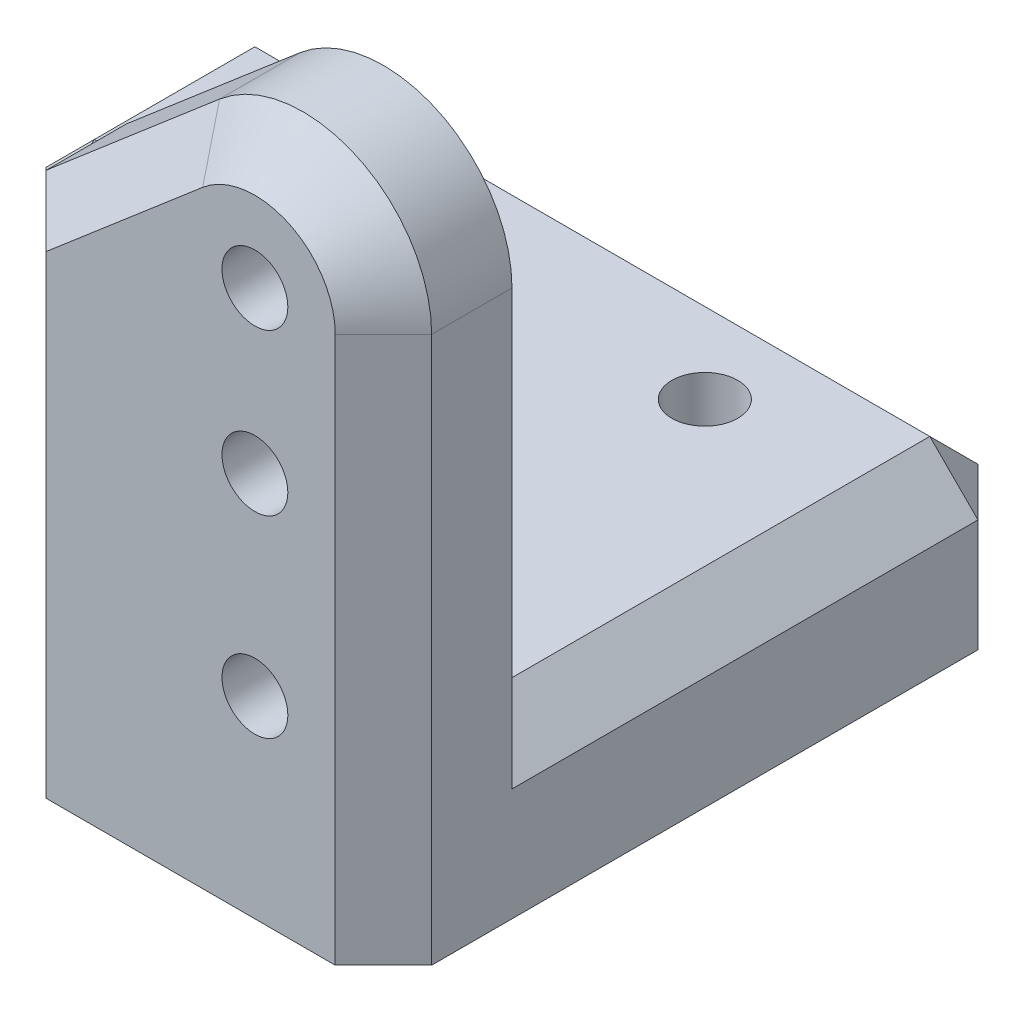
from build123d import *

# Parameters (mm, degrees)
RESSALTO_EXTRUS_O1_DEPTH                      = 20
ESBO_O2_W                                     = 16
ESBO_O2_H                                     = 16
CORTE_EXTRUS_O1_DEPTH                         = 20
CORTE_EXTRUS_O2_DEPTH                         = 34.120990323
CHANFRO2_SIZE                                 = 1.5
FURO_ROSCADO_DE_M2_51_D                       = 2.05
ESBO_O8_W                                     = 8
ESBO_O8_H                                     = 5
RESSALTO_EXTRUS_O2_DEPTH                      = 12
CHANFRO3_SIZE                                 = 1.5
FURO_ROSCADO_DE_M2_52_D                       = 2.05
FURO_ROSCADO_DE_M2_52_DEPTH                   = 7.25
FURO_ROSCADO_DE_M2_52_TIP                     = 0.615882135
BROCA_DE_ROSQUEAR_PARA_TARRAXA_DE_M2_51_D     = 2.05
BROCA_DE_ROSQUEAR_PARA_TARRAXA_DE_M2_51_DEPTH = 4


with BuildPart() as part:
    # Esbo_o1 → Ressalto-extrus_o1 (new body)
    with BuildSketch(Plane.XY):
        with BuildLine():
            Line((0, 0), (0, 12))
            Line((0, 12), (9.400080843, 20.039805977))
            ThreePointArc((9.400080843, 20.039805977), (13.673368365, 20.633158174), (16, 17))
            Line((16, 17), (16, 4))
            Line((16, 4), (16, 0))
            Line((16, 0), (0, 0))
        make_face()
    extrude(amount=RESSALTO_EXTRUS_O1_DEPTH)

    # Esbo_o2 → Corte-extrus_o1 (cut)
    with BuildSketch(Plane(origin=(16, 0, 0), x_dir=(0, 0, -1), z_dir=(1, 0, 0))):
        with Locations((-8, 13)):
            Rectangle(ESBO_O2_W, ESBO_O2_H)
    extrude(amount=-CORTE_EXTRUS_O1_DEPTH, mode=Mode.SUBTRACT)

    # Esbo_o3 → Corte-extrus_o2 (cut, through all)
    with BuildSketch(Plane.XY.offset(20)):
        Polygon((0, 0), (4, 0), (4, 15.42116461), (0, 12), align=None)
    extrude(amount=-CORTE_EXTRUS_O2_DEPTH, mode=Mode.SUBTRACT)

    # Chanfro2
    chanfro2_edges = [part.edges().sort_by_distance(p)[0] for p in [
        (13.673368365, 20.633158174, 20),
        (6.700040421, 17.730485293, 20),
        (4, 7.710582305, 20),
        (16, 8.5, 20),
    ]]
    chamfer(chanfro2_edges, length=CHANFRO2_SIZE)

    # Furo roscado de M2.51 (through all)
    with Locations(Plane(origin=(12, 17, 20), x_dir=(1, 0, 0), z_dir=(0, 0, 1))):
        with Locations((0, 0)):
            Hole(FURO_ROSCADO_DE_M2_51_D / 2)

    # Esbo_o8 → Ressalto-extrus_o2 (add)
    with BuildSketch(Plane.ZY.offset(-4)):
        with Locations((4, 2.5)):
            Rectangle(ESBO_O8_W, ESBO_O8_H)
    extrude(amount=RESSALTO_EXTRUS_O2_DEPTH)

    # Chanfro3
    chanfro3_edges = [part.edges().sort_by_distance(p)[0] for p in [
        (-2, 5, 8),
        (-8, 2.5, 0),
        (-8, 2.5, 8),
        (-8, 5, 4),
        (4, 5, 0),
        (16, 5, 8),
        (16, 2.5, 0),
        (4, 5, 12),
        (4, 2.5, 8),
    ]]
    chamfer(chanfro3_edges, length=CHANFRO3_SIZE)

    # Furo roscado de M2.52
    with Locations(Plane(origin=(-2, 0, 4), x_dir=(0, 0, -1), z_dir=(0, -1, 0))):
        with Locations((0, 0), (0, 12), (-10, 12)):
            Hole(FURO_ROSCADO_DE_M2_52_D / 2, depth=FURO_ROSCADO_DE_M2_52_DEPTH)
            with Locations((0, 0, -(FURO_ROSCADO_DE_M2_52_DEPTH + FURO_ROSCADO_DE_M2_52_TIP / 2))):  # 118° drill point
                Cone(0, FURO_ROSCADO_DE_M2_52_D / 2, FURO_ROSCADO_DE_M2_52_TIP, mode=Mode.SUBTRACT)

    # Broca de rosquear para tarraxa de M2.51
    with Locations(Plane(origin=(12, 6, 20), x_dir=(1, 0, 0), z_dir=(0, 0, 1))):
        with Locations((0, 0), (0, 6)):
            Hole(BROCA_DE_ROSQUEAR_PARA_TARRAXA_DE_M2_51_D / 2, depth=BROCA_DE_ROSQUEAR_PARA_TARRAXA_DE_M2_51_DEPTH)


solid = part.part
